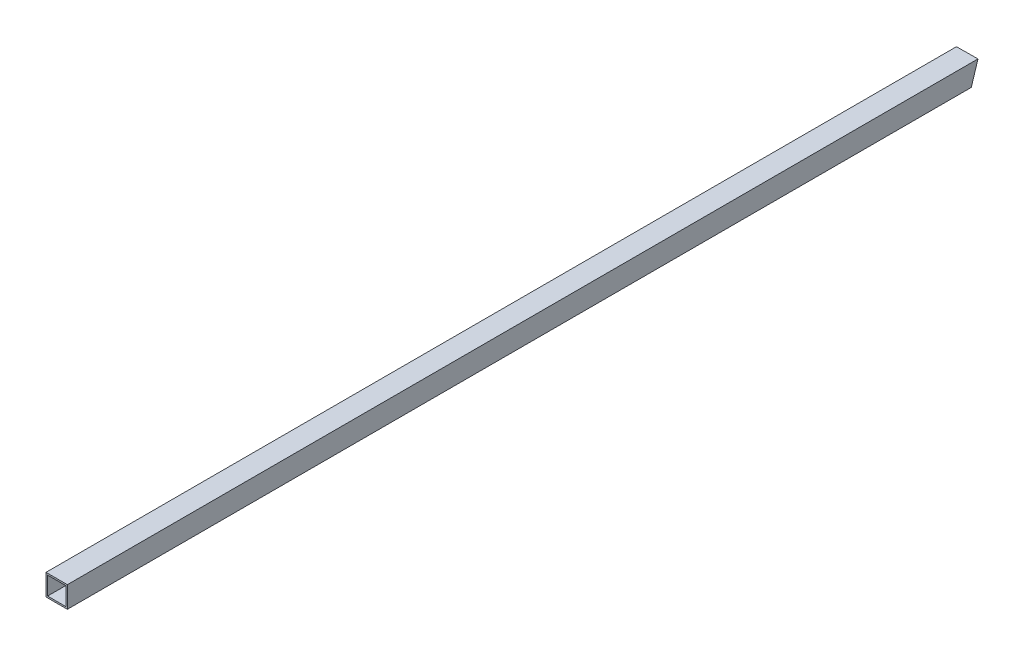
ISO-10303-21;
HEADER;
FILE_DESCRIPTION(('STEP AP214'),'2;1');
FILE_NAME('part.step','',(''),(''),'','','');
FILE_SCHEMA(('AUTOMOTIVE_DESIGN { 1 0 10303 214 1 1 1 1 }'));
ENDSEC;
DATA;
#1=APPLICATION_CONTEXT('core data for automotive mechanical design processes');
#2=APPLICATION_PROTOCOL_DEFINITION('international standard','automotive_design',2000,#1);
#3=PRODUCT_CONTEXT('',#1,'mechanical');
#4=PRODUCT('Part','Part','',(#3));
#5=PRODUCT_RELATED_PRODUCT_CATEGORY('part','',(#4));
#6=PRODUCT_DEFINITION_FORMATION('','',#4);
#7=PRODUCT_DEFINITION_CONTEXT('part definition',#1,'design');
#8=PRODUCT_DEFINITION('design','',#6,#7);
#9=PRODUCT_DEFINITION_SHAPE('','',#8);
#10=(LENGTH_UNIT() NAMED_UNIT(*) SI_UNIT(.MILLI.,.METRE.));
#11=(NAMED_UNIT(*) PLANE_ANGLE_UNIT() SI_UNIT($,.RADIAN.));
#12=(NAMED_UNIT(*) SI_UNIT($,.STERADIAN.) SOLID_ANGLE_UNIT());
#13=UNCERTAINTY_MEASURE_WITH_UNIT(LENGTH_MEASURE(1.E-05),#10,'distance_accuracy_value','');
#14=(GEOMETRIC_REPRESENTATION_CONTEXT(3) GLOBAL_UNCERTAINTY_ASSIGNED_CONTEXT((#13)) GLOBAL_UNIT_ASSIGNED_CONTEXT((#10,
#11,#12)) REPRESENTATION_CONTEXT('',''));
#15=CARTESIAN_POINT('',(0.,0.,0.));
#16=DIRECTION('',(0.,0.,1.));
#17=DIRECTION('',(1.,0.,0.));
#18=AXIS2_PLACEMENT_3D('',#15,#16,#17);
#19=CARTESIAN_POINT('',(-17.,17.,-60.));
#20=DIRECTION('',(1.,0.,0.));
#21=DIRECTION('',(0.,1.,0.));
#22=AXIS2_PLACEMENT_3D('',#19,#20,#21);
#23=PLANE('',#22);
#24=DIRECTION('',(0.,-0.953744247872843,0.300619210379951));
#25=VECTOR('',#24,1.);
#26=CARTESIAN_POINT('',(-17.,16.677779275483,-4.055184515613));
#27=LINE('',#26,#25);
#28=CARTESIAN_POINT('',(-17.,17.,-4.156748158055));
#29=VERTEX_POINT('',#28);
#30=CARTESIAN_POINT('',(-17.,-17.,6.560017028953));
#31=VERTEX_POINT('',#30);
#32=EDGE_CURVE('E124',#29,#31,#27,.T.);
#33=ORIENTED_EDGE('',*,*,#32,.F.);
#34=DIRECTION('',(0.,0.,1.));
#35=VECTOR('',#34,1.);
#36=CARTESIAN_POINT('',(-17.,17.,-60.));
#37=LINE('',#36,#35);
#38=CARTESIAN_POINT('',(-17.,17.,1700.));
#39=VERTEX_POINT('',#38);
#40=EDGE_CURVE('E10',#29,#39,#37,.T.);
#41=ORIENTED_EDGE('',*,*,#40,.T.);
#42=DIRECTION('',(0.,1.,0.));
#43=VECTOR('',#42,1.);
#44=CARTESIAN_POINT('',(-17.,8.5,1700.));
#45=LINE('',#44,#43);
#46=CARTESIAN_POINT('',(-17.,-17.,1700.));
#47=VERTEX_POINT('',#46);
#48=EDGE_CURVE('E144',#47,#39,#45,.T.);
#49=ORIENTED_EDGE('',*,*,#48,.F.);
#50=DIRECTION('',(0.,0.,1.));
#51=VECTOR('',#50,1.);
#52=CARTESIAN_POINT('',(-17.,-17.,-60.));
#53=LINE('',#52,#51);
#54=EDGE_CURVE('E73',#31,#47,#53,.T.);
#55=ORIENTED_EDGE('',*,*,#54,.F.);
#56=EDGE_LOOP('',(#33,#41,#49,#55));
#57=FACE_BOUND('',#56,.T.);
#58=ADVANCED_FACE('F16',(#57),#23,.T.);
#59=CARTESIAN_POINT('',(17.,17.,-60.));
#60=DIRECTION('',(0.,-1.,0.));
#61=DIRECTION('',(0.,0.,-1.));
#62=AXIS2_PLACEMENT_3D('',#59,#60,#61);
#63=PLANE('',#62);
#64=DIRECTION('',(-0.999959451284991,0.,0.00900531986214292));
#65=VECTOR('',#64,1.);
#66=CARTESIAN_POINT('',(8.730649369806,17.,-4.388470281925));
#67=LINE('',#66,#65);
#68=CARTESIAN_POINT('',(17.,17.,-4.462941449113));
#69=VERTEX_POINT('',#68);
#70=EDGE_CURVE('E130',#69,#29,#67,.T.);
#71=ORIENTED_EDGE('',*,*,#70,.F.);
#72=DIRECTION('',(0.,0.,1.));
#73=VECTOR('',#72,1.);
#74=CARTESIAN_POINT('',(17.,17.,-60.));
#75=LINE('',#74,#73);
#76=CARTESIAN_POINT('',(17.,17.,1700.));
#77=VERTEX_POINT('',#76);
#78=EDGE_CURVE('E25',#69,#77,#75,.T.);
#79=ORIENTED_EDGE('',*,*,#78,.T.);
#80=DIRECTION('',(1.,0.,0.));
#81=VECTOR('',#80,1.);
#82=CARTESIAN_POINT('',(8.5,17.,1700.));
#83=LINE('',#82,#81);
#84=EDGE_CURVE('E153',#39,#77,#83,.T.);
#85=ORIENTED_EDGE('',*,*,#84,.F.);
#86=ORIENTED_EDGE('',*,*,#40,.F.);
#87=EDGE_LOOP('',(#71,#79,#85,#86));
#88=FACE_BOUND('',#87,.T.);
#89=ADVANCED_FACE('F18',(#88),#63,.T.);
#90=CARTESIAN_POINT('',(17.,-17.,-60.));
#91=DIRECTION('',(-1.,0.,0.));
#92=DIRECTION('',(0.,0.,1.));
#93=AXIS2_PLACEMENT_3D('',#90,#91,#92);
#94=PLANE('',#93);
#95=DIRECTION('',(0.,0.953744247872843,-0.300619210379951));
#96=VECTOR('',#95,1.);
#97=CARTESIAN_POINT('',(17.,1.126311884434,0.540428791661));
#98=LINE('',#97,#96);
#99=CARTESIAN_POINT('',(17.,-17.,6.253823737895));
#100=VERTEX_POINT('',#99);
#101=EDGE_CURVE('E122',#100,#69,#98,.T.);
#102=ORIENTED_EDGE('',*,*,#101,.F.);
#103=DIRECTION('',(0.,0.,1.));
#104=VECTOR('',#103,1.);
#105=CARTESIAN_POINT('',(17.,-17.,-60.));
#106=LINE('',#105,#104);
#107=CARTESIAN_POINT('',(17.,-17.,1700.));
#108=VERTEX_POINT('',#107);
#109=EDGE_CURVE('E37',#100,#108,#106,.T.);
#110=ORIENTED_EDGE('',*,*,#109,.T.);
#111=DIRECTION('',(0.,-1.,0.));
#112=VECTOR('',#111,1.);
#113=CARTESIAN_POINT('',(17.,-8.5,1700.));
#114=LINE('',#113,#112);
#115=EDGE_CURVE('E157',#77,#108,#114,.T.);
#116=ORIENTED_EDGE('',*,*,#115,.F.);
#117=ORIENTED_EDGE('',*,*,#78,.F.);
#118=EDGE_LOOP('',(#102,#110,#116,#117));
#119=FACE_BOUND('',#118,.T.);
#120=ADVANCED_FACE('F128',(#119),#94,.T.);
#121=CARTESIAN_POINT('',(-17.,-17.,-60.));
#122=DIRECTION('',(0.,1.,0.));
#123=DIRECTION('',(1.,0.,0.));
#124=AXIS2_PLACEMENT_3D('',#121,#122,#123);
#125=PLANE('',#124);
#126=DIRECTION('',(0.999959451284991,0.,-0.00900531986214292));
#127=VECTOR('',#126,1.);
#128=CARTESIAN_POINT('',(-8.17146801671,-17.,6.480510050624));
#129=LINE('',#128,#127);
#130=EDGE_CURVE('E112',#31,#100,#129,.T.);
#131=ORIENTED_EDGE('',*,*,#130,.F.);
#132=ORIENTED_EDGE('',*,*,#54,.T.);
#133=DIRECTION('',(-1.,0.,0.));
#134=VECTOR('',#133,1.);
#135=CARTESIAN_POINT('',(-8.5,-17.,1700.));
#136=LINE('',#135,#134);
#137=EDGE_CURVE('E114',#108,#47,#136,.T.);
#138=ORIENTED_EDGE('',*,*,#137,.F.);
#139=ORIENTED_EDGE('',*,*,#109,.F.);
#140=EDGE_LOOP('',(#131,#132,#138,#139));
#141=FACE_BOUND('',#140,.T.);
#142=ADVANCED_FACE('F111',(#141),#125,.T.);
#143=CARTESIAN_POINT('',(20.,20.,-60.));
#144=DIRECTION('',(0.,-1.,0.));
#145=DIRECTION('',(0.,0.,-1.));
#146=AXIS2_PLACEMENT_3D('',#143,#144,#145);
#147=PLANE('',#146);
#148=DIRECTION('',(0.,0.,1.));
#149=VECTOR('',#148,1.);
#150=CARTESIAN_POINT('',(-20.,20.,-60.));
#151=LINE('',#150,#149);
#152=CARTESIAN_POINT('',(-20.,20.,-5.075328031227));
#153=VERTEX_POINT('',#152);
#154=CARTESIAN_POINT('',(-20.,20.,1700.));
#155=VERTEX_POINT('',#154);
#156=EDGE_CURVE('E84',#153,#155,#151,.T.);
#157=ORIENTED_EDGE('',*,*,#156,.T.);
#158=DIRECTION('',(1.,0.,0.));
#159=VECTOR('',#158,1.);
#160=CARTESIAN_POINT('',(10.,20.,1700.));
#161=LINE('',#160,#159);
#162=CARTESIAN_POINT('',(20.,20.,1700.));
#163=VERTEX_POINT('',#162);
#164=EDGE_CURVE('E145',#155,#163,#161,.T.);
#165=ORIENTED_EDGE('',*,*,#164,.T.);
#166=DIRECTION('',(0.,0.,1.));
#167=VECTOR('',#166,1.);
#168=CARTESIAN_POINT('',(20.,20.,-60.));
#169=LINE('',#168,#167);
#170=CARTESIAN_POINT('',(20.,20.,-5.435555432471));
#171=VERTEX_POINT('',#170);
#172=EDGE_CURVE('E126',#171,#163,#169,.T.);
#173=ORIENTED_EDGE('',*,*,#172,.F.);
#174=DIRECTION('',(-0.999959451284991,0.,0.00900531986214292));
#175=VECTOR('',#174,1.);
#176=CARTESIAN_POINT('',(10.222012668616,20.,-5.347497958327));
#177=LINE('',#176,#175);
#178=EDGE_CURVE('E260',#171,#153,#177,.T.);
#179=ORIENTED_EDGE('',*,*,#178,.T.);
#180=EDGE_LOOP('',(#157,#165,#173,#179));
#181=FACE_BOUND('',#180,.T.);
#182=ADVANCED_FACE('F221',(#181),#147,.F.);
#183=CARTESIAN_POINT('',(-20.,20.,-60.));
#184=DIRECTION('',(1.,0.,0.));
#185=DIRECTION('',(0.,1.,0.));
#186=AXIS2_PLACEMENT_3D('',#183,#184,#185);
#187=PLANE('',#186);
#188=DIRECTION('',(0.,0.,1.));
#189=VECTOR('',#188,1.);
#190=CARTESIAN_POINT('',(-20.,-20.,-60.));
#191=LINE('',#190,#189);
#192=CARTESIAN_POINT('',(-20.,-20.,7.532631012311));
#193=VERTEX_POINT('',#192);
#194=CARTESIAN_POINT('',(-20.,-20.,1700.));
#195=VERTEX_POINT('',#194);
#196=EDGE_CURVE('E268',#193,#195,#191,.T.);
#197=ORIENTED_EDGE('',*,*,#196,.T.);
#198=DIRECTION('',(0.,1.,0.));
#199=VECTOR('',#198,1.);
#200=CARTESIAN_POINT('',(-20.,10.,1700.));
#201=LINE('',#200,#199);
#202=EDGE_CURVE('E142',#195,#155,#201,.T.);
#203=ORIENTED_EDGE('',*,*,#202,.T.);
#204=ORIENTED_EDGE('',*,*,#156,.F.);
#205=DIRECTION('',(0.,-0.953744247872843,0.300619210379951));
#206=VECTOR('',#205,1.);
#207=CARTESIAN_POINT('',(-20.,18.049967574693,-4.460679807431));
#208=LINE('',#207,#206);
#209=EDGE_CURVE('E131',#153,#193,#208,.T.);
#210=ORIENTED_EDGE('',*,*,#209,.T.);
#211=EDGE_LOOP('',(#197,#203,#204,#210));
#212=FACE_BOUND('',#211,.T.);
#213=ADVANCED_FACE('F212',(#212),#187,.F.);
#214=CARTESIAN_POINT('',(0.,0.,1700.));
#215=DIRECTION('',(0.,0.,-1.));
#216=DIRECTION('',(0.,-1.,0.));
#217=AXIS2_PLACEMENT_3D('',#214,#215,#216);
#218=PLANE('',#217);
#219=ORIENTED_EDGE('',*,*,#48,.T.);
#220=ORIENTED_EDGE('',*,*,#84,.T.);
#221=ORIENTED_EDGE('',*,*,#115,.T.);
#222=ORIENTED_EDGE('',*,*,#137,.T.);
#223=EDGE_LOOP('',(#219,#220,#221,#222));
#224=FACE_BOUND('',#223,.T.);
#225=ORIENTED_EDGE('',*,*,#164,.F.);
#226=ORIENTED_EDGE('',*,*,#202,.F.);
#227=DIRECTION('',(-1.,0.,0.));
#228=VECTOR('',#227,1.);
#229=CARTESIAN_POINT('',(-10.,-20.,1700.));
#230=LINE('',#229,#228);
#231=CARTESIAN_POINT('',(20.,-20.,1700.));
#232=VERTEX_POINT('',#231);
#233=EDGE_CURVE('E274',#232,#195,#230,.T.);
#234=ORIENTED_EDGE('',*,*,#233,.F.);
#235=DIRECTION('',(0.,-1.,0.));
#236=VECTOR('',#235,1.);
#237=CARTESIAN_POINT('',(20.,-10.,1700.));
#238=LINE('',#237,#236);
#239=EDGE_CURVE('E148',#163,#232,#238,.T.);
#240=ORIENTED_EDGE('',*,*,#239,.F.);
#241=EDGE_LOOP('',(#225,#226,#234,#240));
#242=FACE_BOUND('',#241,.T.);
#243=ADVANCED_FACE('F194',(#224,#242),#218,.F.);
#244=CARTESIAN_POINT('',(20.,-20.,-60.));
#245=DIRECTION('',(-1.,0.,0.));
#246=DIRECTION('',(0.,0.,1.));
#247=AXIS2_PLACEMENT_3D('',#244,#245,#246);
#248=PLANE('',#247);
#249=ORIENTED_EDGE('',*,*,#172,.T.);
#250=ORIENTED_EDGE('',*,*,#239,.T.);
#251=DIRECTION('',(0.,0.,1.));
#252=VECTOR('',#251,1.);
#253=CARTESIAN_POINT('',(20.,-20.,-60.));
#254=LINE('',#253,#252);
#255=CARTESIAN_POINT('',(20.,-20.,7.172403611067));
#256=VERTEX_POINT('',#255);
#257=EDGE_CURVE('E266',#256,#232,#254,.T.);
#258=ORIENTED_EDGE('',*,*,#257,.F.);
#259=DIRECTION('',(0.,0.953744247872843,-0.300619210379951));
#260=VECTOR('',#259,1.);
#261=CARTESIAN_POINT('',(20.,-0.245876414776,0.94592408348));
#262=LINE('',#261,#260);
#263=EDGE_CURVE('E138',#256,#171,#262,.T.);
#264=ORIENTED_EDGE('',*,*,#263,.T.);
#265=EDGE_LOOP('',(#249,#250,#258,#264));
#266=FACE_BOUND('',#265,.T.);
#267=ADVANCED_FACE('F186',(#266),#248,.F.);
#268=CARTESIAN_POINT('',(0.008588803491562,0.300608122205,0.953709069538));
#269=DIRECTION('',(0.0085888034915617,0.30060812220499,0.953709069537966));
#270=DIRECTION('',(0.999592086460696,-0.0285597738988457,0.));
#271=AXIS2_PLACEMENT_3D('',#268,#269,#270);
#272=PLANE('',#271);
#273=ORIENTED_EDGE('',*,*,#101,.T.);
#274=ORIENTED_EDGE('',*,*,#70,.T.);
#275=ORIENTED_EDGE('',*,*,#32,.T.);
#276=ORIENTED_EDGE('',*,*,#130,.T.);
#277=EDGE_LOOP('',(#273,#274,#275,#276));
#278=FACE_BOUND('',#277,.T.);
#279=ORIENTED_EDGE('',*,*,#178,.F.);
#280=ORIENTED_EDGE('',*,*,#263,.F.);
#281=DIRECTION('',(0.999959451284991,0.,-0.00900531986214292));
#282=VECTOR('',#281,1.);
#283=CARTESIAN_POINT('',(-9.66283131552,-20.,7.439537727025));
#284=LINE('',#283,#282);
#285=EDGE_CURVE('E258',#193,#256,#284,.T.);
#286=ORIENTED_EDGE('',*,*,#285,.F.);
#287=ORIENTED_EDGE('',*,*,#209,.F.);
#288=EDGE_LOOP('',(#279,#280,#286,#287));
#289=FACE_BOUND('',#288,.T.);
#290=ADVANCED_FACE('F119',(#278,#289),#272,.F.);
#291=CARTESIAN_POINT('',(-20.,-20.,-60.));
#292=DIRECTION('',(0.,1.,0.));
#293=DIRECTION('',(1.,0.,0.));
#294=AXIS2_PLACEMENT_3D('',#291,#292,#293);
#295=PLANE('',#294);
#296=ORIENTED_EDGE('',*,*,#257,.T.);
#297=ORIENTED_EDGE('',*,*,#233,.T.);
#298=ORIENTED_EDGE('',*,*,#196,.F.);
#299=ORIENTED_EDGE('',*,*,#285,.T.);
#300=EDGE_LOOP('',(#296,#297,#298,#299));
#301=FACE_BOUND('',#300,.T.);
#302=ADVANCED_FACE('F172',(#301),#295,.F.);
#303=CLOSED_SHELL('',(#58,#89,#120,#142,#182,#213,#243,#267,#290,#302));
#304=MANIFOLD_SOLID_BREP('B1',#303);
#305=ADVANCED_BREP_SHAPE_REPRESENTATION('',(#18,#304),#14);
#306=SHAPE_DEFINITION_REPRESENTATION(#9,#305);
ENDSEC;
END-ISO-10303-21;
